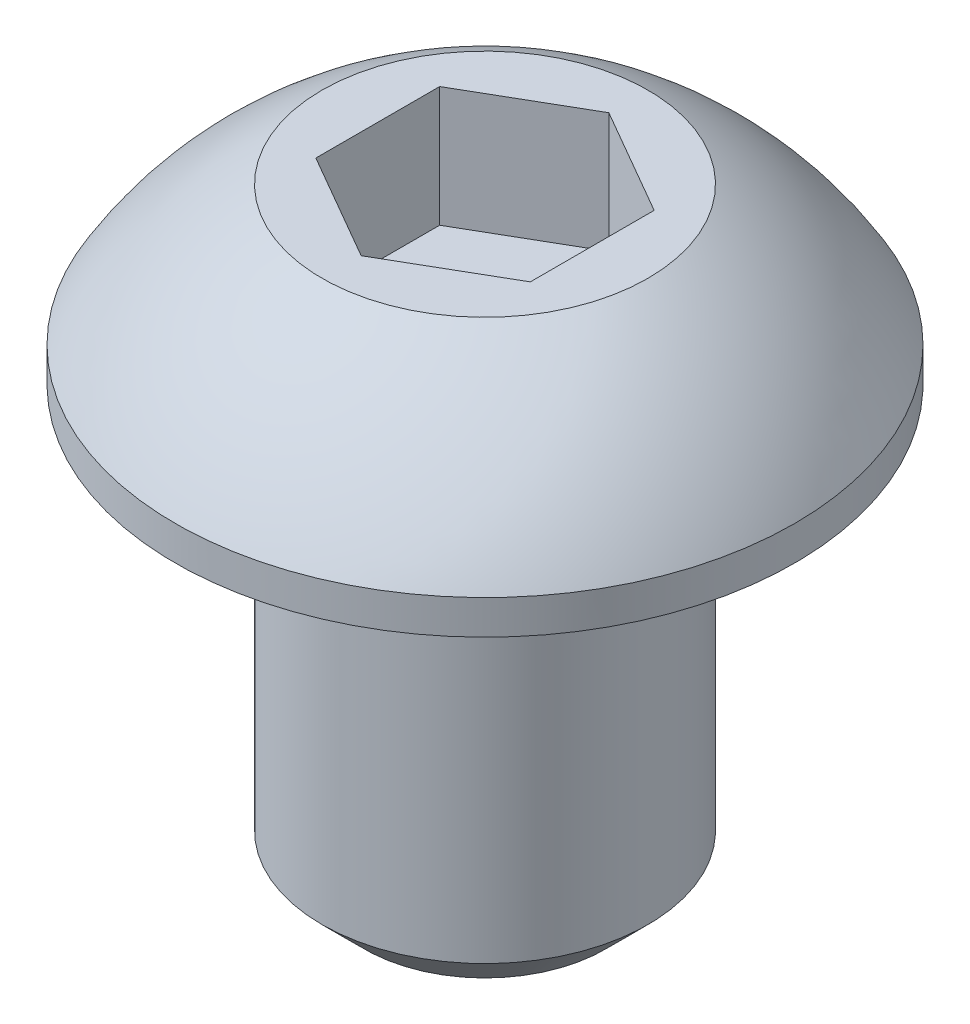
ISO-10303-21;
HEADER;
FILE_DESCRIPTION(('STEP AP214'),'2;1');
FILE_NAME('part.step','',(''),(''),'','','');
FILE_SCHEMA(('AUTOMOTIVE_DESIGN { 1 0 10303 214 1 1 1 1 }'));
ENDSEC;
DATA;
#1=APPLICATION_CONTEXT('core data for automotive mechanical design processes');
#2=APPLICATION_PROTOCOL_DEFINITION('international standard','automotive_design',2000,#1);
#3=PRODUCT_CONTEXT('',#1,'mechanical');
#4=PRODUCT('Part','Part','',(#3));
#5=PRODUCT_RELATED_PRODUCT_CATEGORY('part','',(#4));
#6=PRODUCT_DEFINITION_FORMATION('','',#4);
#7=PRODUCT_DEFINITION_CONTEXT('part definition',#1,'design');
#8=PRODUCT_DEFINITION('design','',#6,#7);
#9=PRODUCT_DEFINITION_SHAPE('','',#8);
#10=(LENGTH_UNIT() NAMED_UNIT(*) SI_UNIT(.MILLI.,.METRE.));
#11=(NAMED_UNIT(*) PLANE_ANGLE_UNIT() SI_UNIT($,.RADIAN.));
#12=(NAMED_UNIT(*) SI_UNIT($,.STERADIAN.) SOLID_ANGLE_UNIT());
#13=UNCERTAINTY_MEASURE_WITH_UNIT(LENGTH_MEASURE(1.E-05),#10,'distance_accuracy_value','');
#14=(GEOMETRIC_REPRESENTATION_CONTEXT(3) GLOBAL_UNCERTAINTY_ASSIGNED_CONTEXT((#13)) GLOBAL_UNIT_ASSIGNED_CONTEXT((#10,
#11,#12)) REPRESENTATION_CONTEXT('',''));
#15=CARTESIAN_POINT('',(0.,0.,0.));
#16=DIRECTION('',(0.,0.,1.));
#17=DIRECTION('',(1.,0.,0.));
#18=AXIS2_PLACEMENT_3D('',#15,#16,#17);
#19=CARTESIAN_POINT('',(0.,0.,0.));
#20=DIRECTION('',(0.,-1.,0.));
#21=DIRECTION('',(0.,0.,-1.));
#22=AXIS2_PLACEMENT_3D('',#19,#20,#21);
#23=PLANE('',#22);
#24=CARTESIAN_POINT('',(0.,0.,0.));
#25=DIRECTION('',(0.,-1.,0.));
#26=DIRECTION('',(0.,0.,-1.));
#27=AXIS2_PLACEMENT_3D('',#24,#25,#26);
#28=CIRCLE('',#27,2.413);
#29=CARTESIAN_POINT('',(0.,0.,-2.413));
#30=VERTEX_POINT('',#29);
#31=EDGE_CURVE('E11',#30,#30,#28,.T.);
#32=ORIENTED_EDGE('',*,*,#31,.F.);
#33=EDGE_LOOP('',(#32));
#34=FACE_BOUND('',#33,.T.);
#35=CARTESIAN_POINT('',(0.,0.,0.));
#36=DIRECTION('',(0.,-1.,0.));
#37=DIRECTION('',(0.,0.,-1.));
#38=AXIS2_PLACEMENT_3D('',#35,#36,#37);
#39=CIRCLE('',#38,4.5847);
#40=CARTESIAN_POINT('',(0.,0.,-4.5847));
#41=VERTEX_POINT('',#40);
#42=EDGE_CURVE('E33',#41,#41,#39,.T.);
#43=ORIENTED_EDGE('',*,*,#42,.T.);
#44=EDGE_LOOP('',(#43));
#45=FACE_BOUND('',#44,.T.);
#46=ADVANCED_FACE('F26',(#34,#45),#23,.T.);
#47=CARTESIAN_POINT('',(0.,0.,0.));
#48=DIRECTION('',(0.,-1.,0.));
#49=DIRECTION('',(0.,0.,-1.));
#50=AXIS2_PLACEMENT_3D('',#47,#48,#49);
#51=CYLINDRICAL_SURFACE('',#50,4.5847);
#52=CARTESIAN_POINT('',(0.,0.508,0.));
#53=DIRECTION('',(0.,-1.,0.));
#54=DIRECTION('',(0.,0.,-1.));
#55=AXIS2_PLACEMENT_3D('',#52,#53,#54);
#56=CIRCLE('',#55,4.5847);
#57=CARTESIAN_POINT('',(4.58469999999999,0.508000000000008,0.));
#58=VERTEX_POINT('',#57);
#59=EDGE_CURVE('E143',#58,#58,#56,.T.);
#60=ORIENTED_EDGE('',*,*,#59,.T.);
#61=EDGE_LOOP('',(#60));
#62=FACE_BOUND('',#61,.T.);
#63=ORIENTED_EDGE('',*,*,#42,.F.);
#64=EDGE_LOOP('',(#63));
#65=FACE_BOUND('',#64,.T.);
#66=ADVANCED_FACE('F149',(#62,#65),#51,.T.);
#67=CARTESIAN_POINT('',(0.,-2.15653055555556,0.));
#68=DIRECTION('',(0.,-1.,0.));
#69=DIRECTION('',(1.,0.,0.));
#70=AXIS2_PLACEMENT_3D('',#67,#68,#69);
#71=SPHERICAL_SURFACE('',#70,5.30275373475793);
#72=CARTESIAN_POINT('',(0.,2.5654,0.));
#73=DIRECTION('',(0.,-1.,0.));
#74=DIRECTION('',(0.,0.,-1.));
#75=AXIS2_PLACEMENT_3D('',#72,#73,#74);
#76=CIRCLE('',#75,2.413);
#77=CARTESIAN_POINT('',(2.41299999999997,2.56540000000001,0.));
#78=VERTEX_POINT('',#77);
#79=EDGE_CURVE('E140',#78,#78,#76,.T.);
#80=CARTESIAN_POINT('',(2.41299999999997,2.56540000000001,0.));
#81=CARTESIAN_POINT('',(2.4411302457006,2.55102492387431,0.));
#82=CARTESIAN_POINT('',(2.46913200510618,2.53639841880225,0.));
#83=CARTESIAN_POINT('',(2.52486967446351,2.50664734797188,0.));
#84=CARTESIAN_POINT('',(2.55260558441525,2.49152278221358,0.));
#85=CARTESIAN_POINT('',(2.60780267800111,2.4607803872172,0.));
#86=CARTESIAN_POINT('',(2.63526386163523,2.44516255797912,0.));
#87=CARTESIAN_POINT('',(2.68990273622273,2.41343863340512,0.));
#88=CARTESIAN_POINT('',(2.71708042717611,2.3973325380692,0.));
#89=CARTESIAN_POINT('',(2.7711436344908,2.36463722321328,0.));
#90=CARTESIAN_POINT('',(2.79802915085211,2.34804800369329,0.));
#91=CARTESIAN_POINT('',(2.8514994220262,2.31439173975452,0.));
#92=CARTESIAN_POINT('',(2.87808417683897,2.29732469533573,0.));
#93=CARTESIAN_POINT('',(2.93094443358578,2.26271823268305,0.));
#94=CARTESIAN_POINT('',(2.95721993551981,2.24517881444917,0.));
#95=CARTESIAN_POINT('',(3.0094532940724,2.20963320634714,0.));
#96=CARTESIAN_POINT('',(3.03541115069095,2.19162701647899,0.));
#97=CARTESIAN_POINT('',(3.08700092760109,2.1551536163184,0.));
#98=CARTESIAN_POINT('',(3.11263284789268,2.13668640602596,0.));
#99=CARTESIAN_POINT('',(3.16356256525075,2.09929686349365,0.));
#100=CARTESIAN_POINT('',(3.18886036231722,2.08037453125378,0.));
#101=CARTESIAN_POINT('',(3.23911375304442,2.0420807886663,0.));
#102=CARTESIAN_POINT('',(3.26406934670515,2.0227093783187,0.));
#103=CARTESIAN_POINT('',(3.3136303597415,1.9835236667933,0.));
#104=CARTESIAN_POINT('',(3.33823577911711,1.9637093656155,0.));
#105=CARTESIAN_POINT('',(3.38708858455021,1.92364420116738,0.));
#106=CARTESIAN_POINT('',(3.41133597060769,1.90339333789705,0.));
#107=CARTESIAN_POINT('',(3.45946496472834,1.86246151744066,0.));
#108=CARTESIAN_POINT('',(3.4833465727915,1.8417805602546,0.));
#109=CARTESIAN_POINT('',(3.53073638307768,1.79999515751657,0.));
#110=CARTESIAN_POINT('',(3.5542445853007,1.7788907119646,0.));
#111=CARTESIAN_POINT('',(3.60088007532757,1.73626507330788,0.));
#112=CARTESIAN_POINT('',(3.62400736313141,1.71474388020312,0.));
#113=CARTESIAN_POINT('',(3.66987363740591,1.67129162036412,0.));
#114=CARTESIAN_POINT('',(3.69261262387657,1.64936055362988,0.));
#115=CARTESIAN_POINT('',(3.7376950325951,1.60509555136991,0.));
#116=CARTESIAN_POINT('',(3.76003845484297,1.58276161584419,0.));
#117=CARTESIAN_POINT('',(3.80432259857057,1.53769800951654,0.));
#118=CARTESIAN_POINT('',(3.82626332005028,1.51496833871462,0.));
#119=CARTESIAN_POINT('',(3.86973505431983,1.46912052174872,0.));
#120=CARTESIAN_POINT('',(3.89126606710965,1.44600237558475,0.));
#121=CARTESIAN_POINT('',(3.93391150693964,1.3993849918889,0.));
#122=CARTESIAN_POINT('',(3.9550259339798,1.37588575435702,0.));
#123=CARTESIAN_POINT('',(3.99683145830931,1.32851369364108,0.));
#124=CARTESIAN_POINT('',(4.01752255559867,1.30464087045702,0.));
#125=CARTESIAN_POINT('',(4.0584748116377,1.25652926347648,0.));
#126=CARTESIAN_POINT('',(4.07873597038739,1.23229047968,0.));
#127=CARTESIAN_POINT('',(4.11882187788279,1.18345469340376,0.));
#128=CARTESIAN_POINT('',(4.13864662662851,1.15885769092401,0.));
#129=CARTESIAN_POINT('',(4.17785338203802,1.10931332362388,0.));
#130=CARTESIAN_POINT('',(4.19723538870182,1.08436595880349,0.));
#131=CARTESIAN_POINT('',(4.23555046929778,1.03412883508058,0.));
#132=CARTESIAN_POINT('',(4.25448354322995,1.00883907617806,0.));
#133=CARTESIAN_POINT('',(4.2918947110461,0.957925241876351,0.));
#134=CARTESIAN_POINT('',(4.31037280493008,0.93230116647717,0.));
#135=CARTESIAN_POINT('',(4.34686811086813,0.880726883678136,0.));
#136=CARTESIAN_POINT('',(4.3648853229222,0.854776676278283,0.));
#137=CARTESIAN_POINT('',(4.40045310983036,0.802558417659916,0.));
#138=CARTESIAN_POINT('',(4.41800368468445,0.776290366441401,0.));
#139=CARTESIAN_POINT('',(4.45263259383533,0.723444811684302,0.));
#140=CARTESIAN_POINT('',(4.46971092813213,0.696867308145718,0.));
#141=CARTESIAN_POINT('',(4.50338989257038,0.643411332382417,0.));
#142=CARTESIAN_POINT('',(4.51999052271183,0.6165328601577,0.));
#143=CARTESIAN_POINT('',(4.5527088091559,0.562483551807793,0.));
#144=CARTESIAN_POINT('',(4.56882646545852,0.535312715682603,0.));
#145=CARTESIAN_POINT('',(4.58469999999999,0.508000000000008,0.));
#146=B_SPLINE_CURVE_WITH_KNOTS('',3,(#80,#81,#82,#83,#84,#85,#86,#87,#88,#89,#90,#91,#92,#93,
#94,#95,#96,#97,#98,#99,#100,#101,#102,#103,#104,#105,#106,#107,#108,#109,#110,#111,#112,#113,
#114,#115,#116,#117,#118,#119,#120,#121,#122,#123,#124,#125,#126,#127,#128,#129,#130,#131,#132,
#133,#134,#135,#136,#137,#138,#139,#140,#141,#142,#143,#144,#145),.UNSPECIFIED.,.F.,.F.,(4,2,2,
2,2,2,2,2,2,2,2,2,2,2,2,2,2,2,2,2,2,2,2,2,2,2,2,2,2,2,2,2,4),(0.,0.0947699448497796,
0.189539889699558,0.284309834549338,0.379079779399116,0.473849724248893,0.568619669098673,
0.663389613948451,0.758159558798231,0.852929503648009,0.947699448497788,1.04246939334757,
1.13723933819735,1.23200928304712,1.3267792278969,1.42154917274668,1.51631911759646,
1.61108906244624,1.70585900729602,1.8006289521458,1.89539889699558,1.99016884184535,
2.08493878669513,2.17970873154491,2.27447867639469,2.36924862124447,2.46401856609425,
2.55878851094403,2.65355845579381,2.74832840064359,2.84309834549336,2.93786829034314,
3.03263823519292),.UNSPECIFIED.);
#147=EDGE_CURVE('BSEAM151',#78,#58,#146,.T.);
#148=ORIENTED_EDGE('',*,*,#79,.T.);
#149=ORIENTED_EDGE('',*,*,#59,.F.);
#150=ORIENTED_EDGE('',*,*,#147,.T.);
#151=ORIENTED_EDGE('',*,*,#147,.F.);
#152=EDGE_LOOP('',(#148,#150,#149,#151));
#153=FACE_BOUND('',#152,.T.);
#154=ADVANCED_FACE('F151',(#153),#71,.T.);
#155=CARTESIAN_POINT('',(2.413,2.56539999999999,0.));
#156=DIRECTION('',(0.,1.,0.));
#157=DIRECTION('',(0.,0.,1.));
#158=AXIS2_PLACEMENT_3D('',#155,#156,#157);
#159=PLANE('',#158);
#160=DIRECTION('',(1.02069071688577E-11,0.,1.));
#161=VECTOR('',#160,1.);
#162=CARTESIAN_POINT('',(-1.58750000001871,2.5654,-0.916543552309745));
#163=LINE('',#162,#161);
#164=CARTESIAN_POINT('',(-1.58750000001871,2.5654,-0.916543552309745));
#165=VERTEX_POINT('',#164);
#166=CARTESIAN_POINT('',(-1.5875,2.5654,0.916543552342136));
#167=VERTEX_POINT('',#166);
#168=EDGE_CURVE('E40',#165,#167,#163,.T.);
#169=ORIENTED_EDGE('',*,*,#168,.F.);
#170=DIRECTION('',(-0.866025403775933,0.,0.500000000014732));
#171=VECTOR('',#170,1.);
#172=CARTESIAN_POINT('',(-2.80678258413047E-11,2.5654,-1.83308710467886));
#173=LINE('',#172,#171);
#174=CARTESIAN_POINT('',(-2.80678258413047E-11,2.5654,-1.83308710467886));
#175=VERTEX_POINT('',#174);
#176=EDGE_CURVE('E110',#175,#165,#173,.T.);
#177=ORIENTED_EDGE('',*,*,#176,.F.);
#178=DIRECTION('',(-0.866025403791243,0.,-0.499999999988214));
#179=VECTOR('',#178,1.);
#180=CARTESIAN_POINT('',(1.58749999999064,2.5654,-0.916543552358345));
#181=LINE('',#180,#179);
#182=CARTESIAN_POINT('',(1.58749999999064,2.5654,-0.916543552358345));
#183=VERTEX_POINT('',#182);
#184=EDGE_CURVE('E104',#183,#175,#181,.T.);
#185=ORIENTED_EDGE('',*,*,#184,.F.);
#186=DIRECTION('',(-1.02067888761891E-11,0.,-1.));
#187=VECTOR('',#186,1.);
#188=CARTESIAN_POINT('',(1.58750000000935,2.5654,0.916543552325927));
#189=LINE('',#188,#187);
#190=CARTESIAN_POINT('',(1.58750000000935,2.5654,0.916543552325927));
#191=VERTEX_POINT('',#190);
#192=EDGE_CURVE('E102',#191,#183,#189,.T.);
#193=ORIENTED_EDGE('',*,*,#192,.F.);
#194=DIRECTION('',(0.866025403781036,0.,-0.500000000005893));
#195=VECTOR('',#194,1.);
#196=CARTESIAN_POINT('',(9.35362898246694E-12,2.5654,1.83308710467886));
#197=LINE('',#196,#195);
#198=CARTESIAN_POINT('',(9.35362898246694E-12,2.5654,1.83308710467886));
#199=VERTEX_POINT('',#198);
#200=EDGE_CURVE('E83',#199,#191,#197,.T.);
#201=ORIENTED_EDGE('',*,*,#200,.F.);
#202=DIRECTION('',(0.86602540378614,0.,0.499999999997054));
#203=VECTOR('',#202,1.);
#204=CARTESIAN_POINT('',(-1.5875,2.5654,0.916543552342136));
#205=LINE('',#204,#203);
#206=EDGE_CURVE('E94',#167,#199,#205,.T.);
#207=ORIENTED_EDGE('',*,*,#206,.F.);
#208=EDGE_LOOP('',(#169,#177,#185,#193,#201,#207));
#209=FACE_BOUND('',#208,.T.);
#210=ORIENTED_EDGE('',*,*,#79,.F.);
#211=EDGE_LOOP('',(#210));
#212=FACE_BOUND('',#211,.T.);
#213=ADVANCED_FACE('F98',(#209,#212),#159,.T.);
#214=CARTESIAN_POINT('',(0.,-6.35,0.));
#215=DIRECTION('',(0.,-1.,0.));
#216=DIRECTION('',(0.,0.,-1.));
#217=AXIS2_PLACEMENT_3D('',#214,#215,#216);
#218=PLANE('',#217);
#219=CARTESIAN_POINT('',(0.,-6.35,0.));
#220=DIRECTION('',(0.,-1.,0.));
#221=DIRECTION('',(0.,0.,-1.));
#222=AXIS2_PLACEMENT_3D('',#219,#220,#221);
#223=CIRCLE('',#222,1.78308);
#224=CARTESIAN_POINT('',(0.,-6.35,-1.78308));
#225=VERTEX_POINT('',#224);
#226=EDGE_CURVE('E137',#225,#225,#223,.T.);
#227=ORIENTED_EDGE('',*,*,#226,.T.);
#228=EDGE_LOOP('',(#227));
#229=FACE_BOUND('',#228,.T.);
#230=ADVANCED_FACE('F163',(#229),#218,.T.);
#231=CARTESIAN_POINT('',(0.,-6.35,0.));
#232=DIRECTION('',(0.,1.,0.));
#233=DIRECTION('',(0.,0.,1.));
#234=AXIS2_PLACEMENT_3D('',#231,#232,#233);
#235=CONICAL_SURFACE('',#234,1.78308,0.785398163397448);
#236=CARTESIAN_POINT('',(0.,-5.72008,0.));
#237=DIRECTION('',(0.,-1.,0.));
#238=DIRECTION('',(0.,0.,-1.));
#239=AXIS2_PLACEMENT_3D('',#236,#237,#238);
#240=CIRCLE('',#239,2.413);
#241=CARTESIAN_POINT('',(0.,-5.72008,-2.413));
#242=VERTEX_POINT('',#241);
#243=EDGE_CURVE('E128',#242,#242,#240,.T.);
#244=ORIENTED_EDGE('',*,*,#243,.T.);
#245=EDGE_LOOP('',(#244));
#246=FACE_BOUND('',#245,.T.);
#247=ORIENTED_EDGE('',*,*,#226,.F.);
#248=EDGE_LOOP('',(#247));
#249=FACE_BOUND('',#248,.T.);
#250=ADVANCED_FACE('F166',(#246,#249),#235,.T.);
#251=CARTESIAN_POINT('',(0.,0.,0.));
#252=DIRECTION('',(0.,-1.,0.));
#253=DIRECTION('',(0.,0.,-1.));
#254=AXIS2_PLACEMENT_3D('',#251,#252,#253);
#255=CYLINDRICAL_SURFACE('',#254,2.413);
#256=ORIENTED_EDGE('',*,*,#31,.T.);
#257=EDGE_LOOP('',(#256));
#258=FACE_BOUND('',#257,.T.);
#259=ORIENTED_EDGE('',*,*,#243,.F.);
#260=EDGE_LOOP('',(#259));
#261=FACE_BOUND('',#260,.T.);
#262=ADVANCED_FACE('F170',(#258,#261),#255,.T.);
#263=CARTESIAN_POINT('',(-1.58750000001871,0.787400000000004,-0.916543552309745));
#264=DIRECTION('',(-1.,0.,1.0206827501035E-11));
#265=DIRECTION('',(1.02069071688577E-11,0.,1.));
#266=AXIS2_PLACEMENT_3D('',#263,#264,#265);
#267=PLANE('',#266);
#268=ORIENTED_EDGE('',*,*,#168,.T.);
#269=DIRECTION('',(0.,1.,0.));
#270=VECTOR('',#269,1.);
#271=CARTESIAN_POINT('',(-1.5875,0.787400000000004,0.916543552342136));
#272=LINE('',#271,#270);
#273=CARTESIAN_POINT('',(-1.5875,0.787400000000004,0.916543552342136));
#274=VERTEX_POINT('',#273);
#275=EDGE_CURVE('E91',#274,#167,#272,.T.);
#276=ORIENTED_EDGE('',*,*,#275,.F.);
#277=DIRECTION('',(1.02069071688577E-11,0.,1.));
#278=VECTOR('',#277,1.);
#279=CARTESIAN_POINT('',(-1.58750000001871,0.787400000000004,-0.916543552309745));
#280=LINE('',#279,#278);
#281=CARTESIAN_POINT('',(-1.58750000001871,0.787400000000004,-0.916543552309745));
#282=VERTEX_POINT('',#281);
#283=EDGE_CURVE('E112',#282,#274,#280,.T.);
#284=ORIENTED_EDGE('',*,*,#283,.F.);
#285=DIRECTION('',(0.,1.,0.));
#286=VECTOR('',#285,1.);
#287=CARTESIAN_POINT('',(-1.58750000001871,0.787400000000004,-0.916543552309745));
#288=LINE('',#287,#286);
#289=EDGE_CURVE('E47',#282,#165,#288,.T.);
#290=ORIENTED_EDGE('',*,*,#289,.T.);
#291=EDGE_LOOP('',(#268,#276,#284,#290));
#292=FACE_BOUND('',#291,.T.);
#293=ADVANCED_FACE('F174',(#292),#267,.F.);
#294=CARTESIAN_POINT('',(-2.80678258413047E-11,0.787400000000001,-1.83308710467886));
#295=DIRECTION('',(-0.500000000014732,0.,-0.866025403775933));
#296=DIRECTION('',(-0.866025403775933,0.,0.500000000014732));
#297=AXIS2_PLACEMENT_3D('',#294,#295,#296);
#298=PLANE('',#297);
#299=ORIENTED_EDGE('',*,*,#176,.T.);
#300=ORIENTED_EDGE('',*,*,#289,.F.);
#301=DIRECTION('',(-0.866025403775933,0.,0.500000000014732));
#302=VECTOR('',#301,1.);
#303=CARTESIAN_POINT('',(-2.80678258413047E-11,0.787400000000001,-1.83308710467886));
#304=LINE('',#303,#302);
#305=CARTESIAN_POINT('',(-2.80678258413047E-11,0.787400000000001,-1.83308710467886));
#306=VERTEX_POINT('',#305);
#307=EDGE_CURVE('E124',#306,#282,#304,.T.);
#308=ORIENTED_EDGE('',*,*,#307,.F.);
#309=DIRECTION('',(0.,1.,0.));
#310=VECTOR('',#309,1.);
#311=CARTESIAN_POINT('',(-2.80678258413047E-11,0.787400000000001,-1.83308710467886));
#312=LINE('',#311,#310);
#313=EDGE_CURVE('E129',#306,#175,#312,.T.);
#314=ORIENTED_EDGE('',*,*,#313,.T.);
#315=EDGE_LOOP('',(#299,#300,#308,#314));
#316=FACE_BOUND('',#315,.T.);
#317=ADVANCED_FACE('F178',(#316),#298,.F.);
#318=CARTESIAN_POINT('',(1.58749999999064,0.787399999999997,-0.916543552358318));
#319=DIRECTION('',(0.499999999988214,0.,-0.866025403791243));
#320=DIRECTION('',(-0.866025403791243,0.,-0.499999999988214));
#321=AXIS2_PLACEMENT_3D('',#318,#319,#320);
#322=PLANE('',#321);
#323=ORIENTED_EDGE('',*,*,#184,.T.);
#324=ORIENTED_EDGE('',*,*,#313,.F.);
#325=DIRECTION('',(-0.866025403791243,0.,-0.499999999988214));
#326=VECTOR('',#325,1.);
#327=CARTESIAN_POINT('',(1.58749999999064,0.787399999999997,-0.916543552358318));
#328=LINE('',#327,#326);
#329=CARTESIAN_POINT('',(1.58749999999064,0.787399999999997,-0.916543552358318));
#330=VERTEX_POINT('',#329);
#331=EDGE_CURVE('E121',#330,#306,#328,.T.);
#332=ORIENTED_EDGE('',*,*,#331,.F.);
#333=DIRECTION('',(0.,1.,0.));
#334=VECTOR('',#333,1.);
#335=CARTESIAN_POINT('',(1.58749999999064,0.787399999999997,-0.916543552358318));
#336=LINE('',#335,#334);
#337=EDGE_CURVE('E131',#330,#183,#336,.T.);
#338=ORIENTED_EDGE('',*,*,#337,.T.);
#339=EDGE_LOOP('',(#323,#324,#332,#338));
#340=FACE_BOUND('',#339,.T.);
#341=ADVANCED_FACE('F187',(#340),#322,.F.);
#342=CARTESIAN_POINT('',(1.58750000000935,0.787399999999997,0.916543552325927));
#343=DIRECTION('',(1.,0.,-1.02067092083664E-11));
#344=DIRECTION('',(-1.02067888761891E-11,0.,-1.));
#345=AXIS2_PLACEMENT_3D('',#342,#343,#344);
#346=PLANE('',#345);
#347=ORIENTED_EDGE('',*,*,#192,.T.);
#348=ORIENTED_EDGE('',*,*,#337,.F.);
#349=DIRECTION('',(-1.02067888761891E-11,0.,-1.));
#350=VECTOR('',#349,1.);
#351=CARTESIAN_POINT('',(1.58750000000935,0.787399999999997,0.916543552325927));
#352=LINE('',#351,#350);
#353=CARTESIAN_POINT('',(1.58750000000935,0.787399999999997,0.916543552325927));
#354=VERTEX_POINT('',#353);
#355=EDGE_CURVE('E118',#354,#330,#352,.T.);
#356=ORIENTED_EDGE('',*,*,#355,.F.);
#357=DIRECTION('',(0.,1.,0.));
#358=VECTOR('',#357,1.);
#359=CARTESIAN_POINT('',(1.58750000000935,0.787399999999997,0.916543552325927));
#360=LINE('',#359,#358);
#361=EDGE_CURVE('E90',#354,#191,#360,.T.);
#362=ORIENTED_EDGE('',*,*,#361,.T.);
#363=EDGE_LOOP('',(#347,#348,#356,#362));
#364=FACE_BOUND('',#363,.T.);
#365=ADVANCED_FACE('F184',(#364),#346,.F.);
#366=CARTESIAN_POINT('',(9.35362898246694E-12,0.787399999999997,1.83308710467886));
#367=DIRECTION('',(0.500000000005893,0.,0.866025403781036));
#368=DIRECTION('',(0.866025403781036,0.,-0.500000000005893));
#369=AXIS2_PLACEMENT_3D('',#366,#367,#368);
#370=PLANE('',#369);
#371=ORIENTED_EDGE('',*,*,#200,.T.);
#372=ORIENTED_EDGE('',*,*,#361,.F.);
#373=DIRECTION('',(0.866025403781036,0.,-0.500000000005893));
#374=VECTOR('',#373,1.);
#375=CARTESIAN_POINT('',(9.35362898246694E-12,0.787399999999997,1.83308710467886));
#376=LINE('',#375,#374);
#377=CARTESIAN_POINT('',(9.35362898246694E-12,0.787399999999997,1.83308710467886));
#378=VERTEX_POINT('',#377);
#379=EDGE_CURVE('E86',#378,#354,#376,.T.);
#380=ORIENTED_EDGE('',*,*,#379,.F.);
#381=DIRECTION('',(0.,1.,0.));
#382=VECTOR('',#381,1.);
#383=CARTESIAN_POINT('',(9.35362898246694E-12,0.787399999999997,1.83308710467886));
#384=LINE('',#383,#382);
#385=EDGE_CURVE('E79',#378,#199,#384,.T.);
#386=ORIENTED_EDGE('',*,*,#385,.T.);
#387=EDGE_LOOP('',(#371,#372,#380,#386));
#388=FACE_BOUND('',#387,.T.);
#389=ADVANCED_FACE('F81',(#388),#370,.F.);
#390=CARTESIAN_POINT('',(-1.5875,0.787400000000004,0.916543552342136));
#391=DIRECTION('',(-0.499999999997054,0.,0.86602540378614));
#392=DIRECTION('',(0.86602540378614,0.,0.499999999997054));
#393=AXIS2_PLACEMENT_3D('',#390,#391,#392);
#394=PLANE('',#393);
#395=ORIENTED_EDGE('',*,*,#206,.T.);
#396=ORIENTED_EDGE('',*,*,#385,.F.);
#397=DIRECTION('',(0.86602540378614,0.,0.499999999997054));
#398=VECTOR('',#397,1.);
#399=CARTESIAN_POINT('',(-1.5875,0.787400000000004,0.916543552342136));
#400=LINE('',#399,#398);
#401=EDGE_CURVE('E115',#274,#378,#400,.T.);
#402=ORIENTED_EDGE('',*,*,#401,.F.);
#403=ORIENTED_EDGE('',*,*,#275,.T.);
#404=EDGE_LOOP('',(#395,#396,#402,#403));
#405=FACE_BOUND('',#404,.T.);
#406=ADVANCED_FACE('F95',(#405),#394,.F.);
#407=CARTESIAN_POINT('',(-1.58749999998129,0.787400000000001,2.74963065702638));
#408=DIRECTION('',(0.,1.,0.));
#409=DIRECTION('',(0.,0.,1.));
#410=AXIS2_PLACEMENT_3D('',#407,#408,#409);
#411=PLANE('',#410);
#412=ORIENTED_EDGE('',*,*,#283,.T.);
#413=ORIENTED_EDGE('',*,*,#401,.T.);
#414=ORIENTED_EDGE('',*,*,#379,.T.);
#415=ORIENTED_EDGE('',*,*,#355,.T.);
#416=ORIENTED_EDGE('',*,*,#331,.T.);
#417=ORIENTED_EDGE('',*,*,#307,.T.);
#418=EDGE_LOOP('',(#412,#413,#414,#415,#416,#417));
#419=FACE_BOUND('',#418,.T.);
#420=ADVANCED_FACE('F181',(#419),#411,.T.);
#421=CLOSED_SHELL('',(#46,#66,#154,#213,#230,#250,#262,#293,#317,#341,#365,#389,#406,#420));
#422=MANIFOLD_SOLID_BREP('B2',#421);
#423=ADVANCED_BREP_SHAPE_REPRESENTATION('',(#18,#422),#14);
#424=SHAPE_DEFINITION_REPRESENTATION(#9,#423);
ENDSEC;
END-ISO-10303-21;
